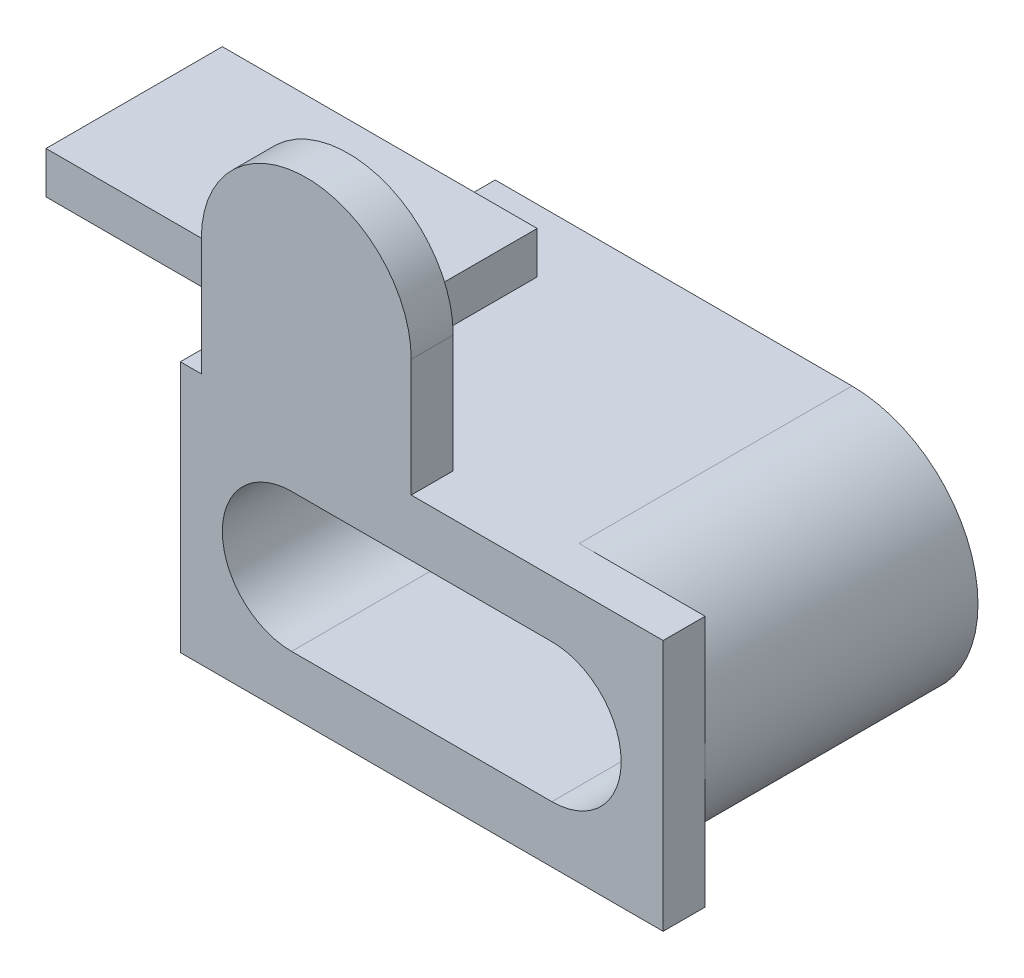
ISO-10303-21;
HEADER;
FILE_DESCRIPTION(('STEP AP214'),'2;1');
FILE_NAME('part.step','',(''),(''),'','','');
FILE_SCHEMA(('AUTOMOTIVE_DESIGN { 1 0 10303 214 1 1 1 1 }'));
ENDSEC;
DATA;
#1=APPLICATION_CONTEXT('core data for automotive mechanical design processes');
#2=APPLICATION_PROTOCOL_DEFINITION('international standard','automotive_design',2000,#1);
#3=PRODUCT_CONTEXT('',#1,'mechanical');
#4=PRODUCT('Part','Part','',(#3));
#5=PRODUCT_RELATED_PRODUCT_CATEGORY('part','',(#4));
#6=PRODUCT_DEFINITION_FORMATION('','',#4);
#7=PRODUCT_DEFINITION_CONTEXT('part definition',#1,'design');
#8=PRODUCT_DEFINITION('design','',#6,#7);
#9=PRODUCT_DEFINITION_SHAPE('','',#8);
#10=(LENGTH_UNIT() NAMED_UNIT(*) SI_UNIT(.MILLI.,.METRE.));
#11=(NAMED_UNIT(*) PLANE_ANGLE_UNIT() SI_UNIT($,.RADIAN.));
#12=(NAMED_UNIT(*) SI_UNIT($,.STERADIAN.) SOLID_ANGLE_UNIT());
#13=UNCERTAINTY_MEASURE_WITH_UNIT(LENGTH_MEASURE(1.E-05),#10,'distance_accuracy_value','');
#14=(GEOMETRIC_REPRESENTATION_CONTEXT(3) GLOBAL_UNCERTAINTY_ASSIGNED_CONTEXT((#13)) GLOBAL_UNIT_ASSIGNED_CONTEXT((#10,
#11,#12)) REPRESENTATION_CONTEXT('',''));
#15=CARTESIAN_POINT('',(0.,0.,0.));
#16=DIRECTION('',(0.,0.,1.));
#17=DIRECTION('',(1.,0.,0.));
#18=AXIS2_PLACEMENT_3D('',#15,#16,#17);
#19=CARTESIAN_POINT('',(-3.75470572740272,2.84478155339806,6.5));
#20=DIRECTION('',(0.,0.,1.));
#21=DIRECTION('',(1.,0.,0.));
#22=AXIS2_PLACEMENT_3D('',#19,#20,#21);
#23=PLANE('',#22);
#24=DIRECTION('',(0.,-1.,0.));
#25=VECTOR('',#24,1.);
#26=CARTESIAN_POINT('',(-1.25470572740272,3.84478155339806,6.5));
#27=LINE('',#26,#25);
#28=CARTESIAN_POINT('',(-1.25470572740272,3.84478155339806,6.5));
#29=VERTEX_POINT('',#28);
#30=CARTESIAN_POINT('',(-1.25470572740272,2.84478155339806,6.5));
#31=VERTEX_POINT('',#30);
#32=EDGE_CURVE('E434',#29,#31,#27,.T.);
#33=ORIENTED_EDGE('',*,*,#32,.F.);
#34=DIRECTION('',(1.,0.,0.));
#35=VECTOR('',#34,1.);
#36=CARTESIAN_POINT('',(-1.25470572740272,3.84478155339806,6.5));
#37=LINE('',#36,#35);
#38=CARTESIAN_POINT('',(-3.25470572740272,3.84478155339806,6.5));
#39=VERTEX_POINT('',#38);
#40=EDGE_CURVE('E225',#39,#29,#37,.T.);
#41=ORIENTED_EDGE('',*,*,#40,.F.);
#42=DIRECTION('',(0.,-1.,0.));
#43=VECTOR('',#42,1.);
#44=CARTESIAN_POINT('',(-3.25470572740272,2.84478155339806,6.5));
#45=LINE('',#44,#43);
#46=CARTESIAN_POINT('',(-3.25470572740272,5.64478155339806,6.5));
#47=VERTEX_POINT('',#46);
#48=EDGE_CURVE('E12',#47,#39,#45,.T.);
#49=ORIENTED_EDGE('',*,*,#48,.F.);
#50=CARTESIAN_POINT('',(-0.754705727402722,5.64478155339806,6.5));
#51=DIRECTION('',(0.,0.,1.));
#52=DIRECTION('',(1.,0.,0.));
#53=AXIS2_PLACEMENT_3D('',#50,#51,#52);
#54=CIRCLE('',#53,2.5);
#55=CARTESIAN_POINT('',(1.74529427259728,5.64478155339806,6.5));
#56=VERTEX_POINT('',#55);
#57=EDGE_CURVE('E282',#56,#47,#54,.T.);
#58=ORIENTED_EDGE('',*,*,#57,.F.);
#59=DIRECTION('',(0.,-1.,0.));
#60=VECTOR('',#59,1.);
#61=CARTESIAN_POINT('',(1.74529427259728,2.84478155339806,6.5));
#62=LINE('',#61,#60);
#63=CARTESIAN_POINT('',(1.74529427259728,2.84478155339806,6.5));
#64=VERTEX_POINT('',#63);
#65=EDGE_CURVE('E275',#56,#64,#62,.T.);
#66=ORIENTED_EDGE('',*,*,#65,.T.);
#67=DIRECTION('',(1.,0.,0.));
#68=VECTOR('',#67,1.);
#69=CARTESIAN_POINT('',(-3.75470572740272,2.84478155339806,6.5));
#70=LINE('',#69,#68);
#71=EDGE_CURVE('E279',#31,#64,#70,.T.);
#72=ORIENTED_EDGE('',*,*,#71,.F.);
#73=EDGE_LOOP('',(#33,#41,#49,#58,#66,#72));
#74=FACE_BOUND('',#73,.T.);
#75=ADVANCED_FACE('F59',(#74),#23,.F.);
#76=CARTESIAN_POINT('',(1.74529427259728,2.84478155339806,7.5));
#77=DIRECTION('',(0.,-1.,0.));
#78=DIRECTION('',(0.,0.,-1.));
#79=AXIS2_PLACEMENT_3D('',#76,#77,#78);
#80=PLANE('',#79);
#81=DIRECTION('',(0.,0.,-1.));
#82=VECTOR('',#81,1.);
#83=CARTESIAN_POINT('',(-1.25470572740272,2.84478155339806,6.5));
#84=LINE('',#83,#82);
#85=CARTESIAN_POINT('',(-1.25470572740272,2.84478155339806,1.5));
#86=VERTEX_POINT('',#85);
#87=EDGE_CURVE('E233',#31,#86,#84,.T.);
#88=ORIENTED_EDGE('',*,*,#87,.F.);
#89=ORIENTED_EDGE('',*,*,#71,.T.);
#90=DIRECTION('',(0.,0.,-1.));
#91=VECTOR('',#90,1.);
#92=CARTESIAN_POINT('',(1.74529427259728,2.84478155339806,7.5));
#93=LINE('',#92,#91);
#94=CARTESIAN_POINT('',(1.74529427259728,2.84478155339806,7.5));
#95=VERTEX_POINT('',#94);
#96=EDGE_CURVE('E371',#95,#64,#93,.T.);
#97=ORIENTED_EDGE('',*,*,#96,.F.);
#98=DIRECTION('',(-1.,0.,0.));
#99=VECTOR('',#98,1.);
#100=CARTESIAN_POINT('',(1.74529427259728,2.84478155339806,7.5));
#101=LINE('',#100,#99);
#102=CARTESIAN_POINT('',(7.74529427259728,2.84478155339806,7.5));
#103=VERTEX_POINT('',#102);
#104=EDGE_CURVE('E341',#103,#95,#101,.T.);
#105=ORIENTED_EDGE('',*,*,#104,.F.);
#106=DIRECTION('',(0.,0.,-1.));
#107=VECTOR('',#106,1.);
#108=CARTESIAN_POINT('',(7.74529427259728,2.84478155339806,7.5));
#109=LINE('',#108,#107);
#110=CARTESIAN_POINT('',(7.74529427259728,2.84478155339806,6.5));
#111=VERTEX_POINT('',#110);
#112=EDGE_CURVE('E375',#103,#111,#109,.T.);
#113=ORIENTED_EDGE('',*,*,#112,.T.);
#114=DIRECTION('',(1.,0.,0.));
#115=VECTOR('',#114,1.);
#116=CARTESIAN_POINT('',(0.,2.84478155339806,6.5));
#117=LINE('',#116,#115);
#118=CARTESIAN_POINT('',(4.74529427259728,2.84478155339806,6.5));
#119=VERTEX_POINT('',#118);
#120=EDGE_CURVE('E263',#119,#111,#117,.T.);
#121=ORIENTED_EDGE('',*,*,#120,.F.);
#122=DIRECTION('',(0.,0.,-1.));
#123=VECTOR('',#122,1.);
#124=CARTESIAN_POINT('',(4.74529427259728,2.84478155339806,6.5));
#125=LINE('',#124,#123);
#126=CARTESIAN_POINT('',(4.74529427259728,2.84478155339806,0.));
#127=VERTEX_POINT('',#126);
#128=EDGE_CURVE('E269',#119,#127,#125,.T.);
#129=ORIENTED_EDGE('',*,*,#128,.T.);
#130=DIRECTION('',(-1.,0.,0.));
#131=VECTOR('',#130,1.);
#132=CARTESIAN_POINT('',(1.74529427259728,2.84478155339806,0.));
#133=LINE('',#132,#131);
#134=CARTESIAN_POINT('',(-3.75470572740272,2.84478155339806,0.));
#135=VERTEX_POINT('',#134);
#136=EDGE_CURVE('E332',#127,#135,#133,.T.);
#137=ORIENTED_EDGE('',*,*,#136,.T.);
#138=DIRECTION('',(0.,0.,-1.));
#139=VECTOR('',#138,1.);
#140=CARTESIAN_POINT('',(-3.75470572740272,2.84478155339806,7.5));
#141=LINE('',#140,#139);
#142=CARTESIAN_POINT('',(-3.75470572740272,2.84478155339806,1.5));
#143=VERTEX_POINT('',#142);
#144=EDGE_CURVE('E386',#143,#135,#141,.T.);
#145=ORIENTED_EDGE('',*,*,#144,.F.);
#146=DIRECTION('',(-1.,0.,0.));
#147=VECTOR('',#146,1.);
#148=CARTESIAN_POINT('',(-1.25470572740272,2.84478155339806,1.5));
#149=LINE('',#148,#147);
#150=EDGE_CURVE('E458',#86,#143,#149,.T.);
#151=ORIENTED_EDGE('',*,*,#150,.F.);
#152=EDGE_LOOP('',(#88,#89,#97,#105,#113,#121,#129,#137,#145,#151));
#153=FACE_BOUND('',#152,.T.);
#154=ADVANCED_FACE('F405',(#153),#80,.F.);
#155=DIRECTION('',(1.,0.,0.));
#156=VECTOR('',#155,1.);
#157=CARTESIAN_POINT('',(-1.25470572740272,2.84478155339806,6.5));
#158=LINE('',#157,#156);
#159=CARTESIAN_POINT('',(-3.75470572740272,2.84478155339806,6.5));
#160=VERTEX_POINT('',#159);
#161=CARTESIAN_POINT('',(-3.25470572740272,2.84478155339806,6.5));
#162=VERTEX_POINT('',#161);
#163=EDGE_CURVE('E229',#160,#162,#158,.T.);
#164=ORIENTED_EDGE('',*,*,#163,.F.);
#165=CARTESIAN_POINT('',(-3.75470572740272,2.84478155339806,7.5));
#166=VERTEX_POINT('',#165);
#167=EDGE_CURVE('E387',#166,#160,#141,.T.);
#168=ORIENTED_EDGE('',*,*,#167,.F.);
#169=DIRECTION('',(-1.,0.,0.));
#170=VECTOR('',#169,1.);
#171=CARTESIAN_POINT('',(-3.75470572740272,2.84478155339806,7.5));
#172=LINE('',#171,#170);
#173=CARTESIAN_POINT('',(-3.25470572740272,2.84478155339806,7.5));
#174=VERTEX_POINT('',#173);
#175=EDGE_CURVE('E327',#174,#166,#172,.T.);
#176=ORIENTED_EDGE('',*,*,#175,.F.);
#177=DIRECTION('',(0.,0.,-1.));
#178=VECTOR('',#177,1.);
#179=CARTESIAN_POINT('',(-3.25470572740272,2.84478155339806,7.5));
#180=LINE('',#179,#178);
#181=EDGE_CURVE('E353',#174,#162,#180,.T.);
#182=ORIENTED_EDGE('',*,*,#181,.T.);
#183=EDGE_LOOP('',(#164,#168,#176,#182));
#184=FACE_BOUND('',#183,.T.);
#185=ADVANCED_FACE('F423',(#184),#80,.F.);
#186=CARTESIAN_POINT('',(-0.754705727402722,5.64478155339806,0.));
#187=DIRECTION('',(0.,0.,1.));
#188=DIRECTION('',(1.,0.,0.));
#189=AXIS2_PLACEMENT_3D('',#186,#187,#188);
#190=PLANE('',#189);
#191=CARTESIAN_POINT('',(-1.10470572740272,-0.155218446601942,0.));
#192=DIRECTION('',(0.,0.,1.));
#193=DIRECTION('',(1.,0.,0.));
#194=AXIS2_PLACEMENT_3D('',#191,#192,#193);
#195=CIRCLE('',#194,1.65);
#196=CARTESIAN_POINT('',(-1.10470572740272,1.49478155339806,0.));
#197=VERTEX_POINT('',#196);
#198=CARTESIAN_POINT('',(-1.10470572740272,-1.80521844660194,0.));
#199=VERTEX_POINT('',#198);
#200=EDGE_CURVE('E285',#197,#199,#195,.T.);
#201=ORIENTED_EDGE('',*,*,#200,.T.);
#202=DIRECTION('',(1.,0.,0.));
#203=VECTOR('',#202,1.);
#204=CARTESIAN_POINT('',(-1.10470572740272,-1.80521844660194,0.));
#205=LINE('',#204,#203);
#206=CARTESIAN_POINT('',(5.09529427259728,-1.80521844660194,0.));
#207=VERTEX_POINT('',#206);
#208=EDGE_CURVE('E303',#199,#207,#205,.T.);
#209=ORIENTED_EDGE('',*,*,#208,.T.);
#210=CARTESIAN_POINT('',(5.09529427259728,-0.155218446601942,0.));
#211=DIRECTION('',(0.,0.,1.));
#212=DIRECTION('',(1.,0.,0.));
#213=AXIS2_PLACEMENT_3D('',#210,#211,#212);
#214=CIRCLE('',#213,1.65);
#215=CARTESIAN_POINT('',(5.09529427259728,1.49478155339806,0.));
#216=VERTEX_POINT('',#215);
#217=EDGE_CURVE('E307',#207,#216,#214,.T.);
#218=ORIENTED_EDGE('',*,*,#217,.T.);
#219=DIRECTION('',(-1.,0.,0.));
#220=VECTOR('',#219,1.);
#221=CARTESIAN_POINT('',(-1.10470572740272,1.49478155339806,0.));
#222=LINE('',#221,#220);
#223=EDGE_CURVE('E290',#216,#197,#222,.T.);
#224=ORIENTED_EDGE('',*,*,#223,.T.);
#225=EDGE_LOOP('',(#201,#209,#218,#224));
#226=FACE_BOUND('',#225,.T.);
#227=CARTESIAN_POINT('',(4.74529427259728,-0.155218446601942,0.));
#228=DIRECTION('',(0.,0.,-1.));
#229=DIRECTION('',(-1.,0.,0.));
#230=AXIS2_PLACEMENT_3D('',#227,#228,#229);
#231=CIRCLE('',#230,3.);
#232=CARTESIAN_POINT('',(4.74529427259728,-3.15521844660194,0.));
#233=VERTEX_POINT('',#232);
#234=EDGE_CURVE('E260',#127,#233,#231,.T.);
#235=ORIENTED_EDGE('',*,*,#234,.T.);
#236=DIRECTION('',(1.,0.,0.));
#237=VECTOR('',#236,1.);
#238=CARTESIAN_POINT('',(-3.75470572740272,-3.15521844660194,0.));
#239=LINE('',#238,#237);
#240=CARTESIAN_POINT('',(-3.75470572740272,-3.15521844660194,0.));
#241=VERTEX_POINT('',#240);
#242=EDGE_CURVE('E326',#241,#233,#239,.T.);
#243=ORIENTED_EDGE('',*,*,#242,.F.);
#244=DIRECTION('',(0.,-1.,0.));
#245=VECTOR('',#244,1.);
#246=CARTESIAN_POINT('',(-3.75470572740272,0.,0.));
#247=LINE('',#246,#245);
#248=EDGE_CURVE('E236',#135,#241,#247,.T.);
#249=ORIENTED_EDGE('',*,*,#248,.F.);
#250=ORIENTED_EDGE('',*,*,#136,.F.);
#251=EDGE_LOOP('',(#235,#243,#249,#250));
#252=FACE_BOUND('',#251,.T.);
#253=ADVANCED_FACE('F408',(#226,#252),#190,.F.);
#254=CARTESIAN_POINT('',(-3.75470572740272,2.84478155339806,7.5));
#255=DIRECTION('',(1.,0.,0.));
#256=DIRECTION('',(0.,1.,0.));
#257=AXIS2_PLACEMENT_3D('',#254,#255,#256);
#258=PLANE('',#257);
#259=ORIENTED_EDGE('',*,*,#248,.T.);
#260=DIRECTION('',(0.,0.,-1.));
#261=VECTOR('',#260,1.);
#262=CARTESIAN_POINT('',(-3.75470572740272,-3.15521844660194,7.5));
#263=LINE('',#262,#261);
#264=CARTESIAN_POINT('',(-3.75470572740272,-3.15521844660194,7.5));
#265=VERTEX_POINT('',#264);
#266=EDGE_CURVE('E383',#265,#241,#263,.T.);
#267=ORIENTED_EDGE('',*,*,#266,.F.);
#268=DIRECTION('',(0.,-1.,0.));
#269=VECTOR('',#268,1.);
#270=CARTESIAN_POINT('',(-3.75470572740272,2.84478155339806,7.5));
#271=LINE('',#270,#269);
#272=EDGE_CURVE('E331',#166,#265,#271,.T.);
#273=ORIENTED_EDGE('',*,*,#272,.F.);
#274=ORIENTED_EDGE('',*,*,#167,.T.);
#275=DIRECTION('',(0.,-1.,0.));
#276=VECTOR('',#275,1.);
#277=CARTESIAN_POINT('',(-3.75470572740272,3.84478155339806,6.5));
#278=LINE('',#277,#276);
#279=CARTESIAN_POINT('',(-3.75470572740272,3.84478155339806,6.5));
#280=VERTEX_POINT('',#279);
#281=EDGE_CURVE('E437',#280,#160,#278,.T.);
#282=ORIENTED_EDGE('',*,*,#281,.F.);
#283=DIRECTION('',(0.,0.,1.));
#284=VECTOR('',#283,1.);
#285=CARTESIAN_POINT('',(-3.75470572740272,3.84478155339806,5.7));
#286=LINE('',#285,#284);
#287=CARTESIAN_POINT('',(-3.75470572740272,3.84478155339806,5.7));
#288=VERTEX_POINT('',#287);
#289=EDGE_CURVE('E467',#288,#280,#286,.T.);
#290=ORIENTED_EDGE('',*,*,#289,.F.);
#291=DIRECTION('',(0.,-1.,0.));
#292=VECTOR('',#291,1.);
#293=CARTESIAN_POINT('',(-3.75470572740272,3.84478155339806,5.7));
#294=LINE('',#293,#292);
#295=CARTESIAN_POINT('',(-3.75470572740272,2.84478155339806,5.7));
#296=VERTEX_POINT('',#295);
#297=EDGE_CURVE('E441',#288,#296,#294,.T.);
#298=ORIENTED_EDGE('',*,*,#297,.T.);
#299=EDGE_CURVE('E390',#296,#143,#141,.T.);
#300=ORIENTED_EDGE('',*,*,#299,.T.);
#301=ORIENTED_EDGE('',*,*,#144,.T.);
#302=EDGE_LOOP('',(#259,#267,#273,#274,#282,#290,#298,#300,#301));
#303=FACE_BOUND('',#302,.T.);
#304=ADVANCED_FACE('F61',(#303),#258,.F.);
#305=CARTESIAN_POINT('',(7.74529427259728,2.84478155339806,7.5));
#306=DIRECTION('',(-1.,0.,0.));
#307=DIRECTION('',(0.,0.,1.));
#308=AXIS2_PLACEMENT_3D('',#305,#306,#307);
#309=PLANE('',#308);
#310=DIRECTION('',(0.,-1.,0.));
#311=VECTOR('',#310,1.);
#312=CARTESIAN_POINT('',(7.74529427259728,0.,6.5));
#313=LINE('',#312,#311);
#314=CARTESIAN_POINT('',(7.74529427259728,-0.155218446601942,6.5));
#315=VERTEX_POINT('',#314);
#316=CARTESIAN_POINT('',(7.74529427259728,-3.15521844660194,6.5));
#317=VERTEX_POINT('',#316);
#318=EDGE_CURVE('E249',#315,#317,#313,.T.);
#319=ORIENTED_EDGE('',*,*,#318,.F.);
#320=DIRECTION('',(0.,-1.,0.));
#321=VECTOR('',#320,1.);
#322=CARTESIAN_POINT('',(7.74529427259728,0.,6.5));
#323=LINE('',#322,#321);
#324=EDGE_CURVE('E266',#111,#315,#323,.T.);
#325=ORIENTED_EDGE('',*,*,#324,.F.);
#326=ORIENTED_EDGE('',*,*,#112,.F.);
#327=DIRECTION('',(0.,1.,0.));
#328=VECTOR('',#327,1.);
#329=CARTESIAN_POINT('',(7.74529427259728,2.84478155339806,7.5));
#330=LINE('',#329,#328);
#331=CARTESIAN_POINT('',(7.74529427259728,-3.15521844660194,7.5));
#332=VERTEX_POINT('',#331);
#333=EDGE_CURVE('E338',#332,#103,#330,.T.);
#334=ORIENTED_EDGE('',*,*,#333,.F.);
#335=DIRECTION('',(0.,0.,-1.));
#336=VECTOR('',#335,1.);
#337=CARTESIAN_POINT('',(7.74529427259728,-3.15521844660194,7.5));
#338=LINE('',#337,#336);
#339=EDGE_CURVE('E379',#332,#317,#338,.T.);
#340=ORIENTED_EDGE('',*,*,#339,.T.);
#341=EDGE_LOOP('',(#319,#325,#326,#334,#340));
#342=FACE_BOUND('',#341,.T.);
#343=ADVANCED_FACE('F525',(#342),#309,.F.);
#344=CARTESIAN_POINT('',(-3.75470572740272,-3.15521844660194,7.5));
#345=DIRECTION('',(0.,1.,0.));
#346=DIRECTION('',(0.,0.,1.));
#347=AXIS2_PLACEMENT_3D('',#344,#345,#346);
#348=PLANE('',#347);
#349=ORIENTED_EDGE('',*,*,#266,.T.);
#350=ORIENTED_EDGE('',*,*,#242,.T.);
#351=DIRECTION('',(0.,0.,-1.));
#352=VECTOR('',#351,1.);
#353=CARTESIAN_POINT('',(4.74529427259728,-3.15521844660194,6.5));
#354=LINE('',#353,#352);
#355=CARTESIAN_POINT('',(4.74529427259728,-3.15521844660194,6.5));
#356=VERTEX_POINT('',#355);
#357=EDGE_CURVE('E256',#356,#233,#354,.T.);
#358=ORIENTED_EDGE('',*,*,#357,.F.);
#359=DIRECTION('',(-1.,0.,0.));
#360=VECTOR('',#359,1.);
#361=CARTESIAN_POINT('',(0.,-3.15521844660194,6.5));
#362=LINE('',#361,#360);
#363=EDGE_CURVE('E252',#317,#356,#362,.T.);
#364=ORIENTED_EDGE('',*,*,#363,.F.);
#365=ORIENTED_EDGE('',*,*,#339,.F.);
#366=DIRECTION('',(1.,0.,0.));
#367=VECTOR('',#366,1.);
#368=CARTESIAN_POINT('',(-3.75470572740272,-3.15521844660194,7.5));
#369=LINE('',#368,#367);
#370=EDGE_CURVE('E335',#265,#332,#369,.T.);
#371=ORIENTED_EDGE('',*,*,#370,.F.);
#372=EDGE_LOOP('',(#349,#350,#358,#364,#365,#371));
#373=FACE_BOUND('',#372,.T.);
#374=ADVANCED_FACE('F411',(#373),#348,.F.);
#375=CARTESIAN_POINT('',(-0.754705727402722,5.64478155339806,7.5));
#376=DIRECTION('',(0.,0.,1.));
#377=DIRECTION('',(1.,0.,0.));
#378=AXIS2_PLACEMENT_3D('',#375,#376,#377);
#379=PLANE('',#378);
#380=ORIENTED_EDGE('',*,*,#175,.T.);
#381=ORIENTED_EDGE('',*,*,#272,.T.);
#382=ORIENTED_EDGE('',*,*,#370,.T.);
#383=ORIENTED_EDGE('',*,*,#333,.T.);
#384=ORIENTED_EDGE('',*,*,#104,.T.);
#385=DIRECTION('',(0.,1.,0.));
#386=VECTOR('',#385,1.);
#387=CARTESIAN_POINT('',(1.74529427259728,2.84478155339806,7.5));
#388=LINE('',#387,#386);
#389=CARTESIAN_POINT('',(1.74529427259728,5.64478155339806,7.5));
#390=VERTEX_POINT('',#389);
#391=EDGE_CURVE('E344',#95,#390,#388,.T.);
#392=ORIENTED_EDGE('',*,*,#391,.T.);
#393=CARTESIAN_POINT('',(-0.754705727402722,5.64478155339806,7.5));
#394=DIRECTION('',(0.,0.,1.));
#395=DIRECTION('',(1.,0.,0.));
#396=AXIS2_PLACEMENT_3D('',#393,#394,#395);
#397=CIRCLE('',#396,2.5);
#398=CARTESIAN_POINT('',(-3.25470572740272,5.64478155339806,7.5));
#399=VERTEX_POINT('',#398);
#400=EDGE_CURVE('E347',#390,#399,#397,.T.);
#401=ORIENTED_EDGE('',*,*,#400,.T.);
#402=DIRECTION('',(0.,-1.,0.));
#403=VECTOR('',#402,1.);
#404=CARTESIAN_POINT('',(-3.25470572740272,2.84478155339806,7.5));
#405=LINE('',#404,#403);
#406=EDGE_CURVE('E350',#399,#174,#405,.T.);
#407=ORIENTED_EDGE('',*,*,#406,.T.);
#408=EDGE_LOOP('',(#380,#381,#382,#383,#384,#392,#401,#407));
#409=FACE_BOUND('',#408,.T.);
#410=DIRECTION('',(1.,0.,0.));
#411=VECTOR('',#410,1.);
#412=CARTESIAN_POINT('',(-1.10470572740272,-1.80521844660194,7.5));
#413=LINE('',#412,#411);
#414=CARTESIAN_POINT('',(-1.10470572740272,-1.80521844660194,7.5));
#415=VERTEX_POINT('',#414);
#416=CARTESIAN_POINT('',(5.09529427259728,-1.80521844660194,7.5));
#417=VERTEX_POINT('',#416);
#418=EDGE_CURVE('E289',#415,#417,#413,.T.);
#419=ORIENTED_EDGE('',*,*,#418,.F.);
#420=CARTESIAN_POINT('',(-1.10470572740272,-0.155218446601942,7.5));
#421=DIRECTION('',(0.,0.,1.));
#422=DIRECTION('',(1.,0.,0.));
#423=AXIS2_PLACEMENT_3D('',#420,#421,#422);
#424=CIRCLE('',#423,1.65);
#425=CARTESIAN_POINT('',(-1.10470572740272,1.49478155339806,7.5));
#426=VERTEX_POINT('',#425);
#427=EDGE_CURVE('E286',#426,#415,#424,.T.);
#428=ORIENTED_EDGE('',*,*,#427,.F.);
#429=DIRECTION('',(-1.,0.,0.));
#430=VECTOR('',#429,1.);
#431=CARTESIAN_POINT('',(-1.10470572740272,1.49478155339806,7.5));
#432=LINE('',#431,#430);
#433=CARTESIAN_POINT('',(5.09529427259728,1.49478155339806,7.5));
#434=VERTEX_POINT('',#433);
#435=EDGE_CURVE('E296',#434,#426,#432,.T.);
#436=ORIENTED_EDGE('',*,*,#435,.F.);
#437=CARTESIAN_POINT('',(5.09529427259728,-0.155218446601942,7.5));
#438=DIRECTION('',(0.,0.,1.));
#439=DIRECTION('',(1.,0.,0.));
#440=AXIS2_PLACEMENT_3D('',#437,#438,#439);
#441=CIRCLE('',#440,1.65);
#442=EDGE_CURVE('E293',#417,#434,#441,.T.);
#443=ORIENTED_EDGE('',*,*,#442,.F.);
#444=EDGE_LOOP('',(#419,#428,#436,#443));
#445=FACE_BOUND('',#444,.T.);
#446=ADVANCED_FACE('F417',(#409,#445),#379,.T.);
#447=CARTESIAN_POINT('',(1.74529427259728,2.84478155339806,7.5));
#448=DIRECTION('',(-1.,0.,0.));
#449=DIRECTION('',(0.,0.,1.));
#450=AXIS2_PLACEMENT_3D('',#447,#448,#449);
#451=PLANE('',#450);
#452=ORIENTED_EDGE('',*,*,#96,.T.);
#453=ORIENTED_EDGE('',*,*,#65,.F.);
#454=DIRECTION('',(0.,0.,-1.));
#455=VECTOR('',#454,1.);
#456=CARTESIAN_POINT('',(1.74529427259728,5.64478155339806,7.5));
#457=LINE('',#456,#455);
#458=EDGE_CURVE('E367',#390,#56,#457,.T.);
#459=ORIENTED_EDGE('',*,*,#458,.F.);
#460=ORIENTED_EDGE('',*,*,#391,.F.);
#461=EDGE_LOOP('',(#452,#453,#459,#460));
#462=FACE_BOUND('',#461,.T.);
#463=ADVANCED_FACE('F511',(#462),#451,.F.);
#464=CARTESIAN_POINT('',(-0.754705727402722,5.64478155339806,7.5));
#465=DIRECTION('',(0.,0.,-1.));
#466=DIRECTION('',(-1.,0.,0.));
#467=AXIS2_PLACEMENT_3D('',#464,#465,#466);
#468=CYLINDRICAL_SURFACE('',#467,2.5);
#469=ORIENTED_EDGE('',*,*,#458,.T.);
#470=ORIENTED_EDGE('',*,*,#57,.T.);
#471=DIRECTION('',(0.,0.,-1.));
#472=VECTOR('',#471,1.);
#473=CARTESIAN_POINT('',(-3.25470572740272,5.64478155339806,7.5));
#474=LINE('',#473,#472);
#475=EDGE_CURVE('E363',#399,#47,#474,.T.);
#476=ORIENTED_EDGE('',*,*,#475,.F.);
#477=ORIENTED_EDGE('',*,*,#400,.F.);
#478=EDGE_LOOP('',(#469,#470,#476,#477));
#479=FACE_BOUND('',#478,.T.);
#480=ADVANCED_FACE('F517',(#479),#468,.T.);
#481=CARTESIAN_POINT('',(-3.25470572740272,2.84478155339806,7.5));
#482=DIRECTION('',(1.,0.,0.));
#483=DIRECTION('',(0.,0.,-1.));
#484=AXIS2_PLACEMENT_3D('',#481,#482,#483);
#485=PLANE('',#484);
#486=ORIENTED_EDGE('',*,*,#475,.T.);
#487=ORIENTED_EDGE('',*,*,#48,.T.);
#488=EDGE_CURVE('E68',#39,#162,#45,.T.);
#489=ORIENTED_EDGE('',*,*,#488,.T.);
#490=ORIENTED_EDGE('',*,*,#181,.F.);
#491=ORIENTED_EDGE('',*,*,#406,.F.);
#492=EDGE_LOOP('',(#486,#487,#489,#490,#491));
#493=FACE_BOUND('',#492,.T.);
#494=ADVANCED_FACE('F507',(#493),#485,.F.);
#495=CARTESIAN_POINT('',(-1.10470572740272,-0.155218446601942,7.5));
#496=DIRECTION('',(0.,0.,-1.));
#497=DIRECTION('',(-1.,0.,0.));
#498=AXIS2_PLACEMENT_3D('',#495,#496,#497);
#499=CYLINDRICAL_SURFACE('',#498,1.65);
#500=ORIENTED_EDGE('',*,*,#200,.F.);
#501=DIRECTION('',(0.,0.,-1.));
#502=VECTOR('',#501,1.);
#503=CARTESIAN_POINT('',(-1.10470572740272,1.49478155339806,7.5));
#504=LINE('',#503,#502);
#505=EDGE_CURVE('E299',#426,#197,#504,.T.);
#506=ORIENTED_EDGE('',*,*,#505,.F.);
#507=ORIENTED_EDGE('',*,*,#427,.T.);
#508=DIRECTION('',(0.,0.,-1.));
#509=VECTOR('',#508,1.);
#510=CARTESIAN_POINT('',(-1.10470572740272,-1.80521844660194,7.5));
#511=LINE('',#510,#509);
#512=EDGE_CURVE('E322',#415,#199,#511,.T.);
#513=ORIENTED_EDGE('',*,*,#512,.T.);
#514=EDGE_LOOP('',(#500,#506,#507,#513));
#515=FACE_BOUND('',#514,.T.);
#516=ADVANCED_FACE('F503',(#515),#499,.F.);
#517=CARTESIAN_POINT('',(-1.10470572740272,-1.80521844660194,7.5));
#518=DIRECTION('',(0.,1.,0.));
#519=DIRECTION('',(0.,0.,1.));
#520=AXIS2_PLACEMENT_3D('',#517,#518,#519);
#521=PLANE('',#520);
#522=ORIENTED_EDGE('',*,*,#208,.F.);
#523=ORIENTED_EDGE('',*,*,#512,.F.);
#524=ORIENTED_EDGE('',*,*,#418,.T.);
#525=DIRECTION('',(0.,0.,-1.));
#526=VECTOR('',#525,1.);
#527=CARTESIAN_POINT('',(5.09529427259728,-1.80521844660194,7.5));
#528=LINE('',#527,#526);
#529=EDGE_CURVE('E319',#417,#207,#528,.T.);
#530=ORIENTED_EDGE('',*,*,#529,.T.);
#531=EDGE_LOOP('',(#522,#523,#524,#530));
#532=FACE_BOUND('',#531,.T.);
#533=ADVANCED_FACE('F499',(#532),#521,.T.);
#534=CARTESIAN_POINT('',(5.09529427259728,-0.155218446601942,7.5));
#535=DIRECTION('',(0.,0.,-1.));
#536=DIRECTION('',(-1.,0.,0.));
#537=AXIS2_PLACEMENT_3D('',#534,#535,#536);
#538=CYLINDRICAL_SURFACE('',#537,1.65);
#539=ORIENTED_EDGE('',*,*,#217,.F.);
#540=ORIENTED_EDGE('',*,*,#529,.F.);
#541=ORIENTED_EDGE('',*,*,#442,.T.);
#542=DIRECTION('',(0.,0.,-1.));
#543=VECTOR('',#542,1.);
#544=CARTESIAN_POINT('',(5.09529427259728,1.49478155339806,7.5));
#545=LINE('',#544,#543);
#546=EDGE_CURVE('E83',#434,#216,#545,.T.);
#547=ORIENTED_EDGE('',*,*,#546,.T.);
#548=EDGE_LOOP('',(#539,#540,#541,#547));
#549=FACE_BOUND('',#548,.T.);
#550=ADVANCED_FACE('F496',(#549),#538,.F.);
#551=CARTESIAN_POINT('',(-1.10470572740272,1.49478155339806,7.5));
#552=DIRECTION('',(0.,-1.,0.));
#553=DIRECTION('',(0.,0.,-1.));
#554=AXIS2_PLACEMENT_3D('',#551,#552,#553);
#555=PLANE('',#554);
#556=ORIENTED_EDGE('',*,*,#223,.F.);
#557=ORIENTED_EDGE('',*,*,#546,.F.);
#558=ORIENTED_EDGE('',*,*,#435,.T.);
#559=ORIENTED_EDGE('',*,*,#505,.T.);
#560=EDGE_LOOP('',(#556,#557,#558,#559));
#561=FACE_BOUND('',#560,.T.);
#562=ADVANCED_FACE('F493',(#561),#555,.T.);
#563=CARTESIAN_POINT('',(4.74529427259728,-0.155218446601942,6.5));
#564=DIRECTION('',(0.,0.,-1.));
#565=DIRECTION('',(-1.,0.,0.));
#566=AXIS2_PLACEMENT_3D('',#563,#564,#565);
#567=CYLINDRICAL_SURFACE('',#566,3.);
#568=ORIENTED_EDGE('',*,*,#234,.F.);
#569=ORIENTED_EDGE('',*,*,#128,.F.);
#570=CARTESIAN_POINT('',(4.74529427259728,-0.155218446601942,6.5));
#571=DIRECTION('',(0.,0.,-1.));
#572=DIRECTION('',(-1.,0.,0.));
#573=AXIS2_PLACEMENT_3D('',#570,#571,#572);
#574=CIRCLE('',#573,3.);
#575=EDGE_CURVE('E75',#119,#315,#574,.T.);
#576=ORIENTED_EDGE('',*,*,#575,.T.);
#577=CARTESIAN_POINT('',(4.74529427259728,-0.155218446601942,6.5));
#578=DIRECTION('',(0.,0.,-1.));
#579=DIRECTION('',(-1.,0.,0.));
#580=AXIS2_PLACEMENT_3D('',#577,#578,#579);
#581=CIRCLE('',#580,3.);
#582=EDGE_CURVE('E241',#315,#356,#581,.T.);
#583=ORIENTED_EDGE('',*,*,#582,.T.);
#584=ORIENTED_EDGE('',*,*,#357,.T.);
#585=EDGE_LOOP('',(#568,#569,#576,#583,#584));
#586=FACE_BOUND('',#585,.T.);
#587=ADVANCED_FACE('F491',(#586),#567,.T.);
#588=CARTESIAN_POINT('',(0.,0.,6.5));
#589=DIRECTION('',(0.,0.,-1.));
#590=DIRECTION('',(-1.,0.,0.));
#591=AXIS2_PLACEMENT_3D('',#588,#589,#590);
#592=PLANE('',#591);
#593=ORIENTED_EDGE('',*,*,#575,.F.);
#594=ORIENTED_EDGE('',*,*,#120,.T.);
#595=ORIENTED_EDGE('',*,*,#324,.T.);
#596=EDGE_LOOP('',(#593,#594,#595));
#597=FACE_BOUND('',#596,.T.);
#598=ADVANCED_FACE('F575',(#597),#592,.T.);
#599=CARTESIAN_POINT('',(0.,0.,6.5));
#600=DIRECTION('',(0.,0.,-1.));
#601=DIRECTION('',(-1.,0.,0.));
#602=AXIS2_PLACEMENT_3D('',#599,#600,#601);
#603=PLANE('',#602);
#604=ORIENTED_EDGE('',*,*,#582,.F.);
#605=ORIENTED_EDGE('',*,*,#318,.T.);
#606=ORIENTED_EDGE('',*,*,#363,.T.);
#607=EDGE_LOOP('',(#604,#605,#606));
#608=FACE_BOUND('',#607,.T.);
#609=ADVANCED_FACE('F582',(#608),#603,.T.);
#610=CARTESIAN_POINT('',(0.,2.84478155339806,0.));
#611=DIRECTION('',(0.,1.,0.));
#612=DIRECTION('',(0.,0.,1.));
#613=AXIS2_PLACEMENT_3D('',#610,#611,#612);
#614=PLANE('',#613);
#615=CARTESIAN_POINT('',(-8.75470572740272,2.84478155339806,1.5));
#616=VERTEX_POINT('',#615);
#617=EDGE_CURVE('E456',#143,#616,#149,.T.);
#618=ORIENTED_EDGE('',*,*,#617,.F.);
#619=ORIENTED_EDGE('',*,*,#299,.F.);
#620=DIRECTION('',(1.,0.,0.));
#621=VECTOR('',#620,1.);
#622=CARTESIAN_POINT('',(-8.75470572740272,2.84478155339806,5.7));
#623=LINE('',#622,#621);
#624=CARTESIAN_POINT('',(-8.75470572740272,2.84478155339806,5.7));
#625=VERTEX_POINT('',#624);
#626=EDGE_CURVE('E426',#625,#296,#623,.T.);
#627=ORIENTED_EDGE('',*,*,#626,.F.);
#628=DIRECTION('',(0.,0.,1.));
#629=VECTOR('',#628,1.);
#630=CARTESIAN_POINT('',(-8.75470572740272,2.84478155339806,5.7));
#631=LINE('',#630,#629);
#632=EDGE_CURVE('E430',#616,#625,#631,.T.);
#633=ORIENTED_EDGE('',*,*,#632,.F.);
#634=EDGE_LOOP('',(#618,#619,#627,#633));
#635=FACE_BOUND('',#634,.T.);
#636=ADVANCED_FACE('F455',(#635),#614,.F.);
#637=CARTESIAN_POINT('',(-1.25470572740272,3.84478155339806,6.5));
#638=DIRECTION('',(0.,0.,-1.));
#639=DIRECTION('',(-1.,0.,0.));
#640=AXIS2_PLACEMENT_3D('',#637,#638,#639);
#641=PLANE('',#640);
#642=ORIENTED_EDGE('',*,*,#163,.T.);
#643=ORIENTED_EDGE('',*,*,#488,.F.);
#644=EDGE_CURVE('E438',#280,#39,#37,.T.);
#645=ORIENTED_EDGE('',*,*,#644,.F.);
#646=ORIENTED_EDGE('',*,*,#281,.T.);
#647=EDGE_LOOP('',(#642,#643,#645,#646));
#648=FACE_BOUND('',#647,.T.);
#649=ADVANCED_FACE('F594',(#648),#641,.F.);
#650=CARTESIAN_POINT('',(-1.25470572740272,3.84478155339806,6.5));
#651=DIRECTION('',(-1.,0.,0.));
#652=DIRECTION('',(0.,0.,1.));
#653=AXIS2_PLACEMENT_3D('',#650,#651,#652);
#654=PLANE('',#653);
#655=ORIENTED_EDGE('',*,*,#87,.T.);
#656=DIRECTION('',(0.,-1.,0.));
#657=VECTOR('',#656,1.);
#658=CARTESIAN_POINT('',(-1.25470572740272,3.84478155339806,1.5));
#659=LINE('',#658,#657);
#660=CARTESIAN_POINT('',(-1.25470572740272,3.84478155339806,1.5));
#661=VERTEX_POINT('',#660);
#662=EDGE_CURVE('E211',#661,#86,#659,.T.);
#663=ORIENTED_EDGE('',*,*,#662,.F.);
#664=DIRECTION('',(0.,0.,-1.));
#665=VECTOR('',#664,1.);
#666=CARTESIAN_POINT('',(-1.25470572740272,3.84478155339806,6.5));
#667=LINE('',#666,#665);
#668=EDGE_CURVE('E219',#29,#661,#667,.T.);
#669=ORIENTED_EDGE('',*,*,#668,.F.);
#670=ORIENTED_EDGE('',*,*,#32,.T.);
#671=EDGE_LOOP('',(#655,#663,#669,#670));
#672=FACE_BOUND('',#671,.T.);
#673=ADVANCED_FACE('F231',(#672),#654,.F.);
#674=CARTESIAN_POINT('',(-1.25470572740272,3.84478155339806,1.5));
#675=DIRECTION('',(0.,0.,1.));
#676=DIRECTION('',(1.,0.,0.));
#677=AXIS2_PLACEMENT_3D('',#674,#675,#676);
#678=PLANE('',#677);
#679=ORIENTED_EDGE('',*,*,#150,.T.);
#680=ORIENTED_EDGE('',*,*,#617,.T.);
#681=DIRECTION('',(0.,-1.,0.));
#682=VECTOR('',#681,1.);
#683=CARTESIAN_POINT('',(-8.75470572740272,3.84478155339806,1.5));
#684=LINE('',#683,#682);
#685=CARTESIAN_POINT('',(-8.75470572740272,3.84478155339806,1.5));
#686=VERTEX_POINT('',#685);
#687=EDGE_CURVE('E214',#686,#616,#684,.T.);
#688=ORIENTED_EDGE('',*,*,#687,.F.);
#689=DIRECTION('',(-1.,0.,0.));
#690=VECTOR('',#689,1.);
#691=CARTESIAN_POINT('',(-1.25470572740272,3.84478155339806,1.5));
#692=LINE('',#691,#690);
#693=EDGE_CURVE('E206',#661,#686,#692,.T.);
#694=ORIENTED_EDGE('',*,*,#693,.F.);
#695=ORIENTED_EDGE('',*,*,#662,.T.);
#696=EDGE_LOOP('',(#679,#680,#688,#694,#695));
#697=FACE_BOUND('',#696,.T.);
#698=ADVANCED_FACE('F209',(#697),#678,.F.);
#699=CARTESIAN_POINT('',(-8.75470572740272,3.84478155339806,5.7));
#700=DIRECTION('',(1.,0.,0.));
#701=DIRECTION('',(0.,0.,-1.));
#702=AXIS2_PLACEMENT_3D('',#699,#700,#701);
#703=PLANE('',#702);
#704=ORIENTED_EDGE('',*,*,#632,.T.);
#705=DIRECTION('',(0.,-1.,0.));
#706=VECTOR('',#705,1.);
#707=CARTESIAN_POINT('',(-8.75470572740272,3.84478155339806,5.7));
#708=LINE('',#707,#706);
#709=CARTESIAN_POINT('',(-8.75470572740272,3.84478155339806,5.7));
#710=VERTEX_POINT('',#709);
#711=EDGE_CURVE('E243',#710,#625,#708,.T.);
#712=ORIENTED_EDGE('',*,*,#711,.F.);
#713=DIRECTION('',(0.,0.,1.));
#714=VECTOR('',#713,1.);
#715=CARTESIAN_POINT('',(-8.75470572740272,3.84478155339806,5.7));
#716=LINE('',#715,#714);
#717=EDGE_CURVE('E218',#686,#710,#716,.T.);
#718=ORIENTED_EDGE('',*,*,#717,.F.);
#719=ORIENTED_EDGE('',*,*,#687,.T.);
#720=EDGE_LOOP('',(#704,#712,#718,#719));
#721=FACE_BOUND('',#720,.T.);
#722=ADVANCED_FACE('F473',(#721),#703,.F.);
#723=CARTESIAN_POINT('',(-8.75470572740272,3.84478155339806,5.7));
#724=DIRECTION('',(0.,0.,-1.));
#725=DIRECTION('',(-1.,0.,0.));
#726=AXIS2_PLACEMENT_3D('',#723,#724,#725);
#727=PLANE('',#726);
#728=ORIENTED_EDGE('',*,*,#626,.T.);
#729=ORIENTED_EDGE('',*,*,#297,.F.);
#730=DIRECTION('',(1.,0.,0.));
#731=VECTOR('',#730,1.);
#732=CARTESIAN_POINT('',(-8.75470572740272,3.84478155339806,5.7));
#733=LINE('',#732,#731);
#734=EDGE_CURVE('E451',#710,#288,#733,.T.);
#735=ORIENTED_EDGE('',*,*,#734,.F.);
#736=ORIENTED_EDGE('',*,*,#711,.T.);
#737=EDGE_LOOP('',(#728,#729,#735,#736));
#738=FACE_BOUND('',#737,.T.);
#739=ADVANCED_FACE('F449',(#738),#727,.F.);
#740=CARTESIAN_POINT('',(0.,3.84478155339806,0.));
#741=DIRECTION('',(0.,1.,0.));
#742=DIRECTION('',(0.,0.,1.));
#743=AXIS2_PLACEMENT_3D('',#740,#741,#742);
#744=PLANE('',#743);
#745=ORIENTED_EDGE('',*,*,#668,.T.);
#746=ORIENTED_EDGE('',*,*,#693,.T.);
#747=ORIENTED_EDGE('',*,*,#717,.T.);
#748=ORIENTED_EDGE('',*,*,#734,.T.);
#749=ORIENTED_EDGE('',*,*,#289,.T.);
#750=ORIENTED_EDGE('',*,*,#644,.T.);
#751=ORIENTED_EDGE('',*,*,#40,.T.);
#752=EDGE_LOOP('',(#745,#746,#747,#748,#749,#750,#751));
#753=FACE_BOUND('',#752,.T.);
#754=ADVANCED_FACE('F222',(#753),#744,.T.);
#755=CLOSED_SHELL('',(#75,#154,#185,#253,#304,#343,#374,#446,#463,#480,#494,#516,#533,#550,#562,
#587,#598,#609,#636,#649,#673,#698,#722,#739,#754));
#756=MANIFOLD_SOLID_BREP('B2',#755);
#757=ADVANCED_BREP_SHAPE_REPRESENTATION('',(#18,#756),#14);
#758=SHAPE_DEFINITION_REPRESENTATION(#9,#757);
ENDSEC;
END-ISO-10303-21;
